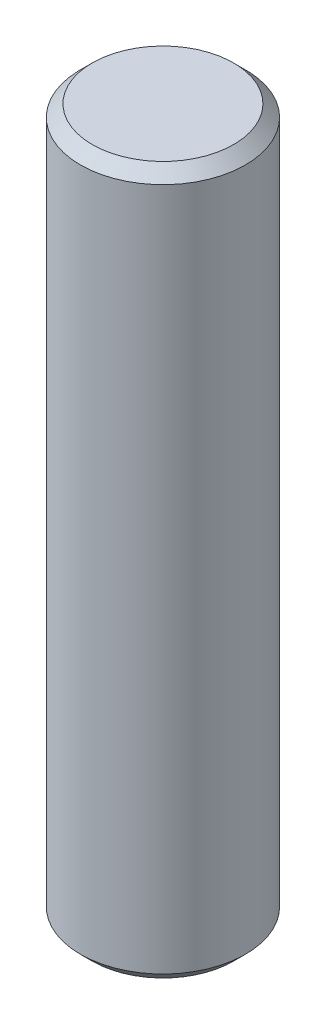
ISO-10303-21;
HEADER;
FILE_DESCRIPTION(('STEP AP214'),'2;1');
FILE_NAME('part.step','',(''),(''),'','','');
FILE_SCHEMA(('AUTOMOTIVE_DESIGN { 1 0 10303 214 1 1 1 1 }'));
ENDSEC;
DATA;
#1=APPLICATION_CONTEXT('core data for automotive mechanical design processes');
#2=APPLICATION_PROTOCOL_DEFINITION('international standard','automotive_design',2000,#1);
#3=PRODUCT_CONTEXT('',#1,'mechanical');
#4=PRODUCT('Part','Part','',(#3));
#5=PRODUCT_RELATED_PRODUCT_CATEGORY('part','',(#4));
#6=PRODUCT_DEFINITION_FORMATION('','',#4);
#7=PRODUCT_DEFINITION_CONTEXT('part definition',#1,'design');
#8=PRODUCT_DEFINITION('design','',#6,#7);
#9=PRODUCT_DEFINITION_SHAPE('','',#8);
#10=(LENGTH_UNIT() NAMED_UNIT(*) SI_UNIT(.MILLI.,.METRE.));
#11=(NAMED_UNIT(*) PLANE_ANGLE_UNIT() SI_UNIT($,.RADIAN.));
#12=(NAMED_UNIT(*) SI_UNIT($,.STERADIAN.) SOLID_ANGLE_UNIT());
#13=UNCERTAINTY_MEASURE_WITH_UNIT(LENGTH_MEASURE(1.E-05),#10,'distance_accuracy_value','');
#14=(GEOMETRIC_REPRESENTATION_CONTEXT(3) GLOBAL_UNCERTAINTY_ASSIGNED_CONTEXT((#13)) GLOBAL_UNIT_ASSIGNED_CONTEXT((#10,
#11,#12)) REPRESENTATION_CONTEXT('',''));
#15=CARTESIAN_POINT('',(0.,0.,0.));
#16=DIRECTION('',(0.,0.,1.));
#17=DIRECTION('',(1.,0.,0.));
#18=AXIS2_PLACEMENT_3D('',#15,#16,#17);
#19=CARTESIAN_POINT('',(0.,-60.,0.));
#20=DIRECTION('',(0.,1.,0.));
#21=DIRECTION('',(0.,0.,1.));
#22=AXIS2_PLACEMENT_3D('',#19,#20,#21);
#23=CYLINDRICAL_SURFACE('',#22,7.);
#24=CARTESIAN_POINT('',(0.,-59.,0.));
#25=DIRECTION('',(0.,1.,0.));
#26=DIRECTION('',(0.,0.,1.));
#27=AXIS2_PLACEMENT_3D('',#24,#25,#26);
#28=CIRCLE('',#27,7.);
#29=CARTESIAN_POINT('',(0.,-59.,7.));
#30=VERTEX_POINT('',#29);
#31=EDGE_CURVE('E44',#30,#30,#28,.T.);
#32=ORIENTED_EDGE('',*,*,#31,.T.);
#33=EDGE_LOOP('',(#32));
#34=FACE_BOUND('',#33,.T.);
#35=CARTESIAN_POINT('',(0.,-1.00000000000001,0.));
#36=DIRECTION('',(0.,1.,0.));
#37=DIRECTION('',(0.,0.,1.));
#38=AXIS2_PLACEMENT_3D('',#35,#36,#37);
#39=CIRCLE('',#38,7.);
#40=CARTESIAN_POINT('',(0.,-1.00000000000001,7.));
#41=VERTEX_POINT('',#40);
#42=EDGE_CURVE('E48',#41,#41,#39,.F.);
#43=ORIENTED_EDGE('',*,*,#42,.T.);
#44=EDGE_LOOP('',(#43));
#45=FACE_BOUND('',#44,.T.);
#46=ADVANCED_FACE('F33',(#34,#45),#23,.T.);
#47=CARTESIAN_POINT('',(0.,-60.,0.));
#48=DIRECTION('',(0.,1.,0.));
#49=DIRECTION('',(0.,0.,1.));
#50=AXIS2_PLACEMENT_3D('',#47,#48,#49);
#51=PLANE('',#50);
#52=CARTESIAN_POINT('',(0.,-60.,0.));
#53=DIRECTION('',(0.,1.,0.));
#54=DIRECTION('',(0.,0.,1.));
#55=AXIS2_PLACEMENT_3D('',#52,#53,#54);
#56=CIRCLE('',#55,5.99999999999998);
#57=CARTESIAN_POINT('',(0.,-60.,5.99999999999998));
#58=VERTEX_POINT('',#57);
#59=EDGE_CURVE('E40',#58,#58,#56,.F.);
#60=ORIENTED_EDGE('',*,*,#59,.T.);
#61=EDGE_LOOP('',(#60));
#62=FACE_BOUND('',#61,.T.);
#63=ADVANCED_FACE('F64',(#62),#51,.F.);
#64=CARTESIAN_POINT('',(0.,0.,0.));
#65=DIRECTION('',(0.,1.,0.));
#66=DIRECTION('',(0.,0.,1.));
#67=AXIS2_PLACEMENT_3D('',#64,#65,#66);
#68=PLANE('',#67);
#69=CARTESIAN_POINT('',(0.,0.,0.));
#70=DIRECTION('',(0.,1.,0.));
#71=DIRECTION('',(0.,0.,1.));
#72=AXIS2_PLACEMENT_3D('',#69,#70,#71);
#73=CIRCLE('',#72,6.);
#74=CARTESIAN_POINT('',(0.,0.,6.));
#75=VERTEX_POINT('',#74);
#76=EDGE_CURVE('E10',#75,#75,#73,.T.);
#77=ORIENTED_EDGE('',*,*,#76,.T.);
#78=EDGE_LOOP('',(#77));
#79=FACE_BOUND('',#78,.T.);
#80=ADVANCED_FACE('F61',(#79),#68,.T.);
#81=CARTESIAN_POINT('',(0.,-59.,0.));
#82=DIRECTION('',(0.,1.,0.));
#83=DIRECTION('',(0.,0.,1.));
#84=AXIS2_PLACEMENT_3D('',#81,#82,#83);
#85=CONICAL_SURFACE('',#84,7.,0.785398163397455);
#86=ORIENTED_EDGE('',*,*,#59,.F.);
#87=EDGE_LOOP('',(#86));
#88=FACE_BOUND('',#87,.T.);
#89=ORIENTED_EDGE('',*,*,#31,.F.);
#90=EDGE_LOOP('',(#89));
#91=FACE_BOUND('',#90,.T.);
#92=ADVANCED_FACE('F57',(#88,#91),#85,.T.);
#93=CARTESIAN_POINT('',(0.,0.,0.));
#94=DIRECTION('',(0.,-1.,0.));
#95=DIRECTION('',(0.,0.,-1.));
#96=AXIS2_PLACEMENT_3D('',#93,#94,#95);
#97=CONICAL_SURFACE('',#96,6.,0.785398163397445);
#98=ORIENTED_EDGE('',*,*,#42,.F.);
#99=EDGE_LOOP('',(#98));
#100=FACE_BOUND('',#99,.T.);
#101=ORIENTED_EDGE('',*,*,#76,.F.);
#102=EDGE_LOOP('',(#101));
#103=FACE_BOUND('',#102,.T.);
#104=ADVANCED_FACE('F35',(#100,#103),#97,.T.);
#105=CLOSED_SHELL('',(#46,#63,#80,#92,#104));
#106=MANIFOLD_SOLID_BREP('B2',#105);
#107=ADVANCED_BREP_SHAPE_REPRESENTATION('',(#18,#106),#14);
#108=SHAPE_DEFINITION_REPRESENTATION(#9,#107);
ENDSEC;
END-ISO-10303-21;
